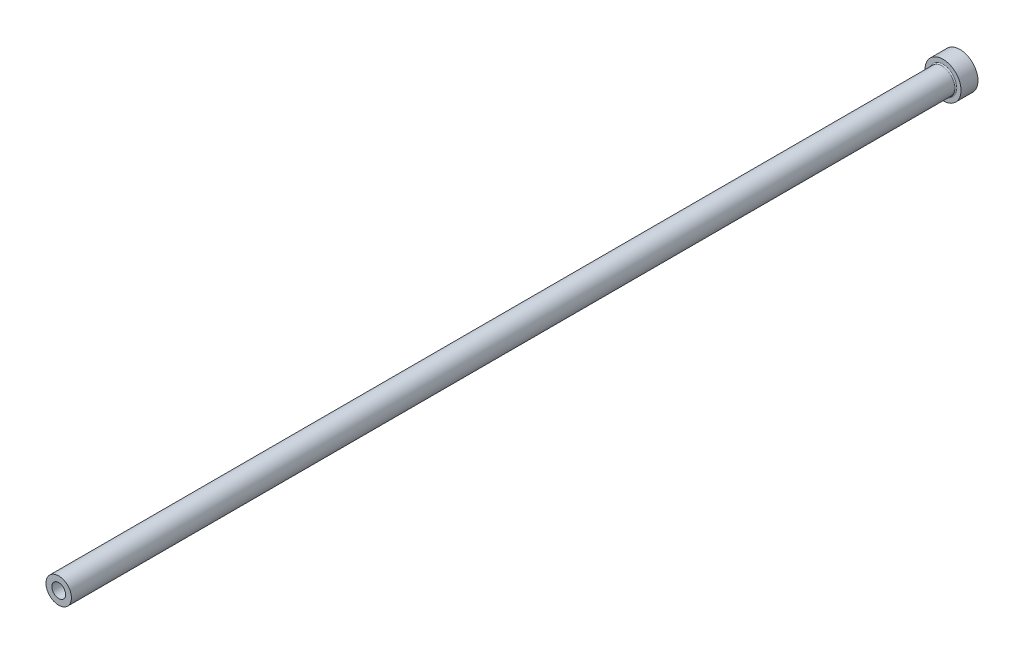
from build123d import *

# Parameters (mm, degrees)
HEAD_FILLET_R          = 0.5
ID_RELIEF_CHAMFER_SIZE = 0.5


with BuildPart() as part:
    # OD FV → Base Revolve (revolve)
    with BuildSketch(Plane(origin=(0, 0, 0), x_dir=(1, 0, 0), z_dir=(0, 1, 0))):
        Polygon((0, -425), (6, -425), (6, -8), (8.5, -8), (8.5, 0), (0, 0), align=None)
    revolve(axis=Axis((0, 0, 425), (0, 0, -1)))

    # ID FV → Hole (revolve, cut)
    with BuildSketch(Plane(origin=(0, 0, 0), x_dir=(1, 0, 0), z_dir=(0, 1, 0))):
        Polygon((0, -425), (3.25, -425), (3.25, -275), (3.5, -274.566987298), (3.5, 0), (0, 0), align=None)
    revolve(axis=Axis((0, 0, 425), (0, 0, -1)), mode=Mode.SUBTRACT)

    # Head Fillet
    head_fillet_edges = [part.edges().sort_by_distance(p)[0] for p in [
        (-6, 0, 8),
    ]]
    fillet(head_fillet_edges, radius=HEAD_FILLET_R)

    # ID Relief Chamfer
    id_relief_chamfer_edges = [part.edges().sort_by_distance(p)[0] for p in [
        (-3.5, 0, 0),
    ]]
    chamfer(id_relief_chamfer_edges, length=ID_RELIEF_CHAMFER_SIZE)


solid = part.part
